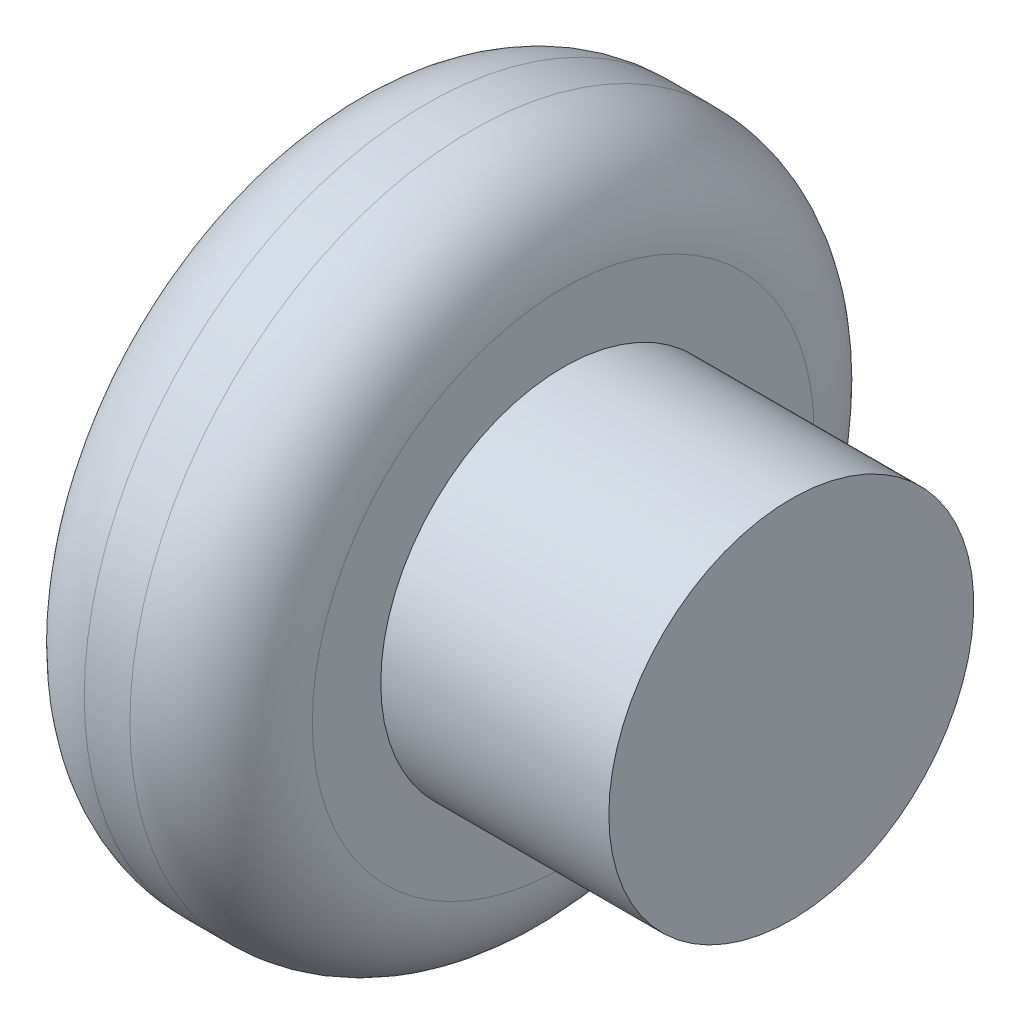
ISO-10303-21;
HEADER;
FILE_DESCRIPTION(('STEP AP214'),'2;1');
FILE_NAME('part.step','',(''),(''),'','','');
FILE_SCHEMA(('AUTOMOTIVE_DESIGN { 1 0 10303 214 1 1 1 1 }'));
ENDSEC;
DATA;
#1=APPLICATION_CONTEXT('core data for automotive mechanical design processes');
#2=APPLICATION_PROTOCOL_DEFINITION('international standard','automotive_design',2000,#1);
#3=PRODUCT_CONTEXT('',#1,'mechanical');
#4=PRODUCT('Part','Part','',(#3));
#5=PRODUCT_RELATED_PRODUCT_CATEGORY('part','',(#4));
#6=PRODUCT_DEFINITION_FORMATION('','',#4);
#7=PRODUCT_DEFINITION_CONTEXT('part definition',#1,'design');
#8=PRODUCT_DEFINITION('design','',#6,#7);
#9=PRODUCT_DEFINITION_SHAPE('','',#8);
#10=(LENGTH_UNIT() NAMED_UNIT(*) SI_UNIT(.MILLI.,.METRE.));
#11=(NAMED_UNIT(*) PLANE_ANGLE_UNIT() SI_UNIT($,.RADIAN.));
#12=(NAMED_UNIT(*) SI_UNIT($,.STERADIAN.) SOLID_ANGLE_UNIT());
#13=UNCERTAINTY_MEASURE_WITH_UNIT(LENGTH_MEASURE(1.E-05),#10,'distance_accuracy_value','');
#14=(GEOMETRIC_REPRESENTATION_CONTEXT(3) GLOBAL_UNCERTAINTY_ASSIGNED_CONTEXT((#13)) GLOBAL_UNIT_ASSIGNED_CONTEXT((#10,
#11,#12)) REPRESENTATION_CONTEXT('',''));
#15=CARTESIAN_POINT('',(0.,0.,0.));
#16=DIRECTION('',(0.,0.,1.));
#17=DIRECTION('',(1.,0.,0.));
#18=AXIS2_PLACEMENT_3D('',#15,#16,#17);
#19=CARTESIAN_POINT('',(0.,0.,0.));
#20=DIRECTION('',(1.,0.,0.));
#21=DIRECTION('',(0.,0.,-1.));
#22=AXIS2_PLACEMENT_3D('',#19,#20,#21);
#23=PLANE('',#22);
#24=CARTESIAN_POINT('',(0.,0.,0.));
#25=DIRECTION('',(-1.,0.,0.));
#26=DIRECTION('',(0.,0.,1.));
#27=AXIS2_PLACEMENT_3D('',#24,#25,#26);
#28=CIRCLE('',#27,11.);
#29=CARTESIAN_POINT('',(0.,0.,11.));
#30=VERTEX_POINT('',#29);
#31=EDGE_CURVE('E10',#30,#30,#28,.T.);
#32=ORIENTED_EDGE('',*,*,#31,.T.);
#33=EDGE_LOOP('',(#32));
#34=FACE_BOUND('',#33,.T.);
#35=ADVANCED_FACE('F32',(#34),#23,.F.);
#36=CARTESIAN_POINT('',(4.,0.,0.));
#37=DIRECTION('',(-1.,0.,0.));
#38=DIRECTION('',(0.,0.,1.));
#39=AXIS2_PLACEMENT_3D('',#36,#37,#38);
#40=TOROIDAL_SURFACE('',#39,11.,4.);
#41=ORIENTED_EDGE('',*,*,#31,.F.);
#42=EDGE_LOOP('',(#41));
#43=FACE_BOUND('',#42,.T.);
#44=CARTESIAN_POINT('',(4.,0.,0.));
#45=DIRECTION('',(-1.,0.,0.));
#46=DIRECTION('',(0.,0.,1.));
#47=AXIS2_PLACEMENT_3D('',#44,#45,#46);
#48=CIRCLE('',#47,15.);
#49=CARTESIAN_POINT('',(4.,0.,15.));
#50=VERTEX_POINT('',#49);
#51=EDGE_CURVE('E38',#50,#50,#48,.T.);
#52=ORIENTED_EDGE('',*,*,#51,.T.);
#53=EDGE_LOOP('',(#52));
#54=FACE_BOUND('',#53,.T.);
#55=ADVANCED_FACE('F70',(#43,#54),#40,.T.);
#56=CARTESIAN_POINT('',(0.,0.,0.));
#57=DIRECTION('',(-1.,0.,0.));
#58=DIRECTION('',(0.,0.,1.));
#59=AXIS2_PLACEMENT_3D('',#56,#57,#58);
#60=CYLINDRICAL_SURFACE('',#59,15.);
#61=ORIENTED_EDGE('',*,*,#51,.F.);
#62=EDGE_LOOP('',(#61));
#63=FACE_BOUND('',#62,.T.);
#64=CARTESIAN_POINT('',(6.,0.,0.));
#65=DIRECTION('',(-1.,0.,0.));
#66=DIRECTION('',(0.,0.,1.));
#67=AXIS2_PLACEMENT_3D('',#64,#65,#66);
#68=CIRCLE('',#67,15.);
#69=CARTESIAN_POINT('',(6.,0.,15.));
#70=VERTEX_POINT('',#69);
#71=EDGE_CURVE('E42',#70,#70,#68,.T.);
#72=ORIENTED_EDGE('',*,*,#71,.T.);
#73=EDGE_LOOP('',(#72));
#74=FACE_BOUND('',#73,.T.);
#75=ADVANCED_FACE('F74',(#63,#74),#60,.T.);
#76=CARTESIAN_POINT('',(6.,0.,0.));
#77=DIRECTION('',(-1.,0.,0.));
#78=DIRECTION('',(0.,0.,1.));
#79=AXIS2_PLACEMENT_3D('',#76,#77,#78);
#80=TOROIDAL_SURFACE('',#79,11.,4.);
#81=ORIENTED_EDGE('',*,*,#71,.F.);
#82=EDGE_LOOP('',(#81));
#83=FACE_BOUND('',#82,.T.);
#84=CARTESIAN_POINT('',(10.,0.,0.));
#85=DIRECTION('',(-1.,0.,0.));
#86=DIRECTION('',(0.,0.,1.));
#87=AXIS2_PLACEMENT_3D('',#84,#85,#86);
#88=CIRCLE('',#87,11.);
#89=CARTESIAN_POINT('',(10.,0.,11.));
#90=VERTEX_POINT('',#89);
#91=EDGE_CURVE('E46',#90,#90,#88,.T.);
#92=ORIENTED_EDGE('',*,*,#91,.T.);
#93=EDGE_LOOP('',(#92));
#94=FACE_BOUND('',#93,.T.);
#95=ADVANCED_FACE('F79',(#83,#94),#80,.T.);
#96=CARTESIAN_POINT('',(10.,8.,0.));
#97=DIRECTION('',(-1.,0.,0.));
#98=DIRECTION('',(0.,0.,1.));
#99=AXIS2_PLACEMENT_3D('',#96,#97,#98);
#100=PLANE('',#99);
#101=ORIENTED_EDGE('',*,*,#91,.F.);
#102=EDGE_LOOP('',(#101));
#103=FACE_BOUND('',#102,.T.);
#104=CARTESIAN_POINT('',(10.,0.,0.));
#105=DIRECTION('',(-1.,0.,0.));
#106=DIRECTION('',(0.,0.,1.));
#107=AXIS2_PLACEMENT_3D('',#104,#105,#106);
#108=CIRCLE('',#107,8.);
#109=CARTESIAN_POINT('',(10.,0.,8.));
#110=VERTEX_POINT('',#109);
#111=EDGE_CURVE('E51',#110,#110,#108,.T.);
#112=ORIENTED_EDGE('',*,*,#111,.T.);
#113=EDGE_LOOP('',(#112));
#114=FACE_BOUND('',#113,.T.);
#115=ADVANCED_FACE('F66',(#103,#114),#100,.F.);
#116=CARTESIAN_POINT('',(0.,0.,0.));
#117=DIRECTION('',(-1.,0.,0.));
#118=DIRECTION('',(0.,0.,1.));
#119=AXIS2_PLACEMENT_3D('',#116,#117,#118);
#120=CYLINDRICAL_SURFACE('',#119,8.);
#121=ORIENTED_EDGE('',*,*,#111,.F.);
#122=EDGE_LOOP('',(#121));
#123=FACE_BOUND('',#122,.T.);
#124=CARTESIAN_POINT('',(20.,0.,0.));
#125=DIRECTION('',(-1.,0.,0.));
#126=DIRECTION('',(0.,0.,1.));
#127=AXIS2_PLACEMENT_3D('',#124,#125,#126);
#128=CIRCLE('',#127,8.);
#129=CARTESIAN_POINT('',(20.,0.,8.));
#130=VERTEX_POINT('',#129);
#131=EDGE_CURVE('E54',#130,#130,#128,.T.);
#132=ORIENTED_EDGE('',*,*,#131,.T.);
#133=EDGE_LOOP('',(#132));
#134=FACE_BOUND('',#133,.T.);
#135=ADVANCED_FACE('F58',(#123,#134),#120,.T.);
#136=CARTESIAN_POINT('',(20.,0.,0.));
#137=DIRECTION('',(-1.,0.,0.));
#138=DIRECTION('',(0.,0.,1.));
#139=AXIS2_PLACEMENT_3D('',#136,#137,#138);
#140=PLANE('',#139);
#141=ORIENTED_EDGE('',*,*,#131,.F.);
#142=EDGE_LOOP('',(#141));
#143=FACE_BOUND('',#142,.T.);
#144=ADVANCED_FACE('F60',(#143),#140,.F.);
#145=CLOSED_SHELL('',(#35,#55,#75,#95,#115,#135,#144));
#146=MANIFOLD_SOLID_BREP('B2',#145);
#147=ADVANCED_BREP_SHAPE_REPRESENTATION('',(#18,#146),#14);
#148=SHAPE_DEFINITION_REPRESENTATION(#9,#147);
ENDSEC;
END-ISO-10303-21;
